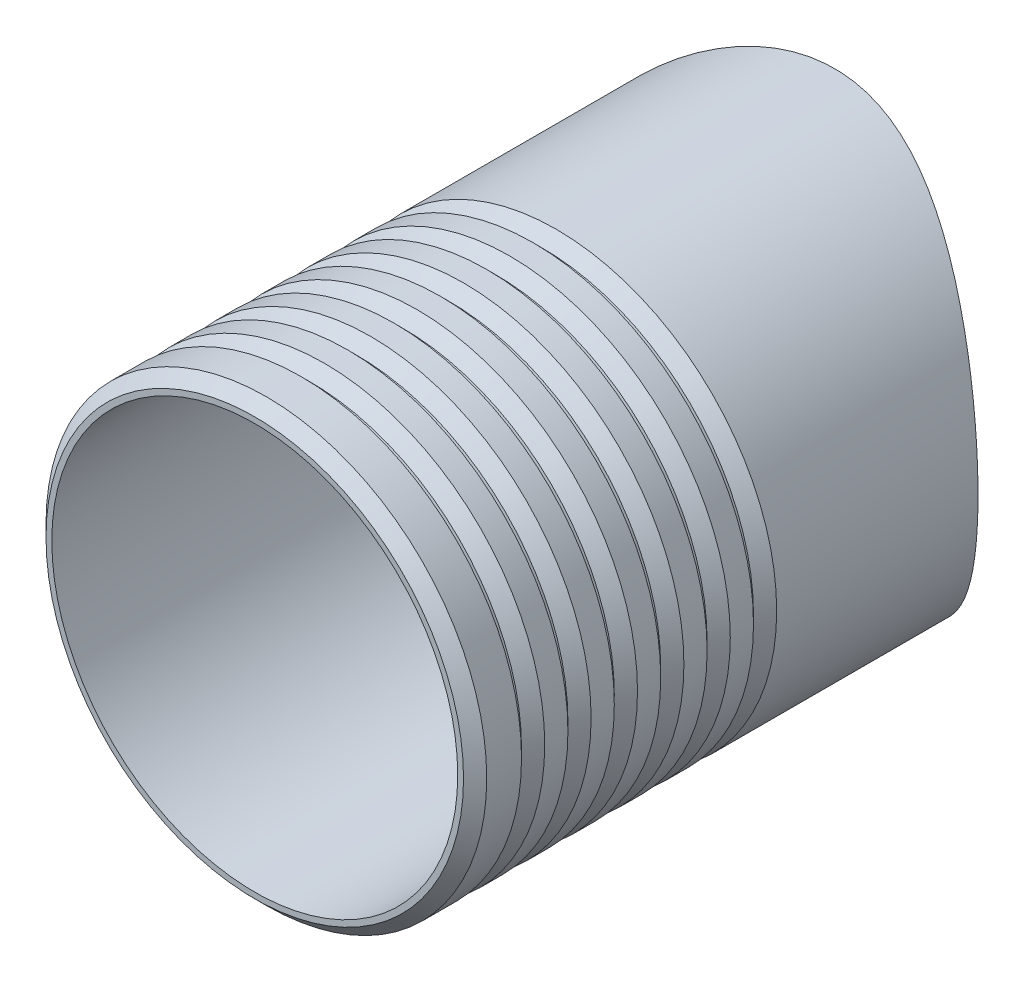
from build123d import *

# Parameters (mm, degrees)
ESQUISSE1_R                = 38
ESQUISSE1_R_2              = 35
EXTRUSION1_DEPTH           = 100
EXTRUSION2_DEPTH           = 114.525327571
EXTRUSION2_DEPTH_BACK      = 114.525327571
ESQUISSE2_R                = 61
CHANFREIN1_SIZE            = 2
R_P_TITION_LIN_AIRE1_COUNT = 6
R_P_TITION_LIN_AIRE1_PITCH = 8


with BuildPart() as part:
    # Esquisse1 → Extrusion1 (new body)
    with BuildSketch(Plane.XY):
        Circle(ESQUISSE1_R)
        Circle(ESQUISSE1_R_2, mode=Mode.SUBTRACT)
    extrude(amount=EXTRUSION1_DEPTH)

    # Esquisse2 → Extrusion2 (cut, two sides: drawn at the far end of the back side and taken through both)
    with BuildSketch(Plane(origin=(0, 0, 0), x_dir=(0, 0, -1), z_dir=(1, 0, 0)).offset(-EXTRUSION2_DEPTH_BACK)):
        with Locations((47.717921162, 0)):
            Circle(ESQUISSE2_R)
    extrude(amount=EXTRUSION2_DEPTH + EXTRUSION2_DEPTH_BACK, mode=Mode.SUBTRACT)

    # Chanfrein1
    chanfrein1_edges = [part.edges().sort_by_distance(p)[0] for p in [
        (-38, 0, 100),
    ]]
    chamfer(chanfrein1_edges, length=CHANFREIN1_SIZE)

    # Esquisse3 → Enl_vement de mati_re-R_volution1 (revolve, cut)
    with BuildSketch(Plane(origin=(0, 0, 0), x_dir=(0, 0, -1), z_dir=(1, 0, 0)), mode=Mode.PRIVATE) as enl_vement_de_mati_re_r_volution1_sk:
        Polygon((-92, 38), (-88, 38), (-90.5, 36.5), (-92, 36.5), align=None)
    enl_vement_de_mati_re_r_volution1 = revolve(enl_vement_de_mati_re_r_volution1_sk.sketch.rotate(Axis((0, 0, 100), (0, 0, -1)), 90), axis=Axis((0, 0, 100), (0, 0, -1)), mode=Mode.SUBTRACT)

    # R_p_tition lin_aire1: Enl_vement de mati_re-R_volution1 ×6
    with Locations(*[(0, 0, -i * R_P_TITION_LIN_AIRE1_PITCH) for i in range(1, R_P_TITION_LIN_AIRE1_COUNT)]):
        add(enl_vement_de_mati_re_r_volution1, mode=Mode.SUBTRACT)


solid = part.part
